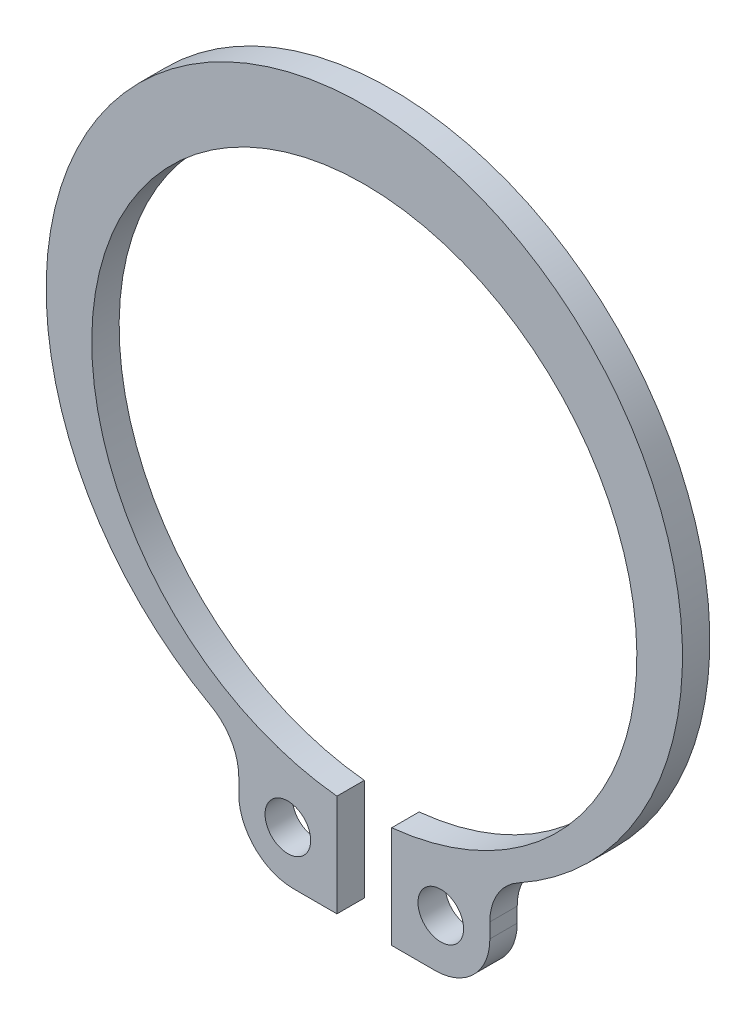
ISO-10303-21;
HEADER;
FILE_DESCRIPTION(('STEP AP214'),'2;1');
FILE_NAME('part.step','',(''),(''),'','','');
FILE_SCHEMA(('AUTOMOTIVE_DESIGN { 1 0 10303 214 1 1 1 1 }'));
ENDSEC;
DATA;
#1=APPLICATION_CONTEXT('core data for automotive mechanical design processes');
#2=APPLICATION_PROTOCOL_DEFINITION('international standard','automotive_design',2000,#1);
#3=PRODUCT_CONTEXT('',#1,'mechanical');
#4=PRODUCT('Part','Part','',(#3));
#5=PRODUCT_RELATED_PRODUCT_CATEGORY('part','',(#4));
#6=PRODUCT_DEFINITION_FORMATION('','',#4);
#7=PRODUCT_DEFINITION_CONTEXT('part definition',#1,'design');
#8=PRODUCT_DEFINITION('design','',#6,#7);
#9=PRODUCT_DEFINITION_SHAPE('','',#8);
#10=(LENGTH_UNIT() NAMED_UNIT(*) SI_UNIT(.MILLI.,.METRE.));
#11=(NAMED_UNIT(*) PLANE_ANGLE_UNIT() SI_UNIT($,.RADIAN.));
#12=(NAMED_UNIT(*) SI_UNIT($,.STERADIAN.) SOLID_ANGLE_UNIT());
#13=UNCERTAINTY_MEASURE_WITH_UNIT(LENGTH_MEASURE(1.E-05),#10,'distance_accuracy_value','');
#14=(GEOMETRIC_REPRESENTATION_CONTEXT(3) GLOBAL_UNCERTAINTY_ASSIGNED_CONTEXT((#13)) GLOBAL_UNIT_ASSIGNED_CONTEXT((#10,
#11,#12)) REPRESENTATION_CONTEXT('',''));
#15=CARTESIAN_POINT('',(0.,0.,0.));
#16=DIRECTION('',(0.,0.,1.));
#17=DIRECTION('',(1.,0.,0.));
#18=AXIS2_PLACEMENT_3D('',#15,#16,#17);
#19=CARTESIAN_POINT('',(-7.90464606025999,-13.3122000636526,1.2));
#20=DIRECTION('',(0.,0.,-1.));
#21=DIRECTION('',(-1.,0.,0.));
#22=AXIS2_PLACEMENT_3D('',#19,#20,#21);
#23=CYLINDRICAL_SURFACE('',#22,2.4);
#24=CARTESIAN_POINT('',(-7.90464606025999,-13.3122000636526,0.));
#25=DIRECTION('',(0.,0.,1.));
#26=DIRECTION('',(1.,0.,0.));
#27=AXIS2_PLACEMENT_3D('',#24,#25,#26);
#28=CIRCLE('',#27,2.4);
#29=CARTESIAN_POINT('',(-5.50464606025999,-13.3122000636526,0.));
#30=VERTEX_POINT('',#29);
#31=CARTESIAN_POINT('',(-6.74433104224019,-11.2113266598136,0.));
#32=VERTEX_POINT('',#31);
#33=EDGE_CURVE('E139',#30,#32,#28,.T.);
#34=ORIENTED_EDGE('',*,*,#33,.F.);
#35=DIRECTION('',(0.,0.,-1.));
#36=VECTOR('',#35,1.);
#37=CARTESIAN_POINT('',(-5.50464606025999,-13.3122000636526,1.2));
#38=LINE('',#37,#36);
#39=CARTESIAN_POINT('',(-5.50464606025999,-13.3122000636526,1.2));
#40=VERTEX_POINT('',#39);
#41=EDGE_CURVE('E44',#40,#30,#38,.T.);
#42=ORIENTED_EDGE('',*,*,#41,.F.);
#43=CARTESIAN_POINT('',(-7.90464606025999,-13.3122000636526,1.2));
#44=DIRECTION('',(0.,0.,1.));
#45=DIRECTION('',(1.,0.,0.));
#46=AXIS2_PLACEMENT_3D('',#43,#44,#45);
#47=CIRCLE('',#46,2.4);
#48=CARTESIAN_POINT('',(-6.74433104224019,-11.2113266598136,1.2));
#49=VERTEX_POINT('',#48);
#50=EDGE_CURVE('E169',#40,#49,#47,.T.);
#51=ORIENTED_EDGE('',*,*,#50,.T.);
#52=DIRECTION('',(0.,0.,-1.));
#53=VECTOR('',#52,1.);
#54=CARTESIAN_POINT('',(-6.74433104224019,-11.2113266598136,1.2));
#55=LINE('',#54,#53);
#56=EDGE_CURVE('E11',#49,#32,#55,.T.);
#57=ORIENTED_EDGE('',*,*,#56,.T.);
#58=EDGE_LOOP('',(#34,#42,#51,#57));
#59=FACE_BOUND('',#58,.T.);
#60=ADVANCED_FACE('F30',(#59),#23,.F.);
#61=CARTESIAN_POINT('',(0.,1.,1.2));
#62=DIRECTION('',(0.,0.,-1.));
#63=DIRECTION('',(-1.,0.,0.));
#64=AXIS2_PLACEMENT_3D('',#61,#62,#63);
#65=CYLINDRICAL_SURFACE('',#64,13.95);
#66=CARTESIAN_POINT('',(0.,1.,0.));
#67=DIRECTION('',(0.,0.,1.));
#68=DIRECTION('',(1.,0.,0.));
#69=AXIS2_PLACEMENT_3D('',#66,#67,#68);
#70=CIRCLE('',#69,13.95);
#71=CARTESIAN_POINT('',(6.74433104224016,-11.2113266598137,0.));
#72=VERTEX_POINT('',#71);
#73=EDGE_CURVE('E121',#72,#32,#70,.T.);
#74=ORIENTED_EDGE('',*,*,#73,.T.);
#75=ORIENTED_EDGE('',*,*,#56,.F.);
#76=CARTESIAN_POINT('',(0.,1.,1.2));
#77=DIRECTION('',(0.,0.,1.));
#78=DIRECTION('',(1.,0.,0.));
#79=AXIS2_PLACEMENT_3D('',#76,#77,#78);
#80=CIRCLE('',#79,13.95);
#81=CARTESIAN_POINT('',(6.74433104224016,-11.2113266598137,1.2));
#82=VERTEX_POINT('',#81);
#83=EDGE_CURVE('E124',#82,#49,#80,.T.);
#84=ORIENTED_EDGE('',*,*,#83,.F.);
#85=DIRECTION('',(0.,0.,-1.));
#86=VECTOR('',#85,1.);
#87=CARTESIAN_POINT('',(6.74433104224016,-11.2113266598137,1.2));
#88=LINE('',#87,#86);
#89=EDGE_CURVE('E33',#82,#72,#88,.T.);
#90=ORIENTED_EDGE('',*,*,#89,.T.);
#91=EDGE_LOOP('',(#74,#75,#84,#90));
#92=FACE_BOUND('',#91,.T.);
#93=ADVANCED_FACE('F119',(#92),#65,.T.);
#94=CARTESIAN_POINT('',(7.90464606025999,-13.3122000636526,1.2));
#95=DIRECTION('',(0.,0.,-1.));
#96=DIRECTION('',(-1.,0.,0.));
#97=AXIS2_PLACEMENT_3D('',#94,#95,#96);
#98=CYLINDRICAL_SURFACE('',#97,2.4);
#99=CARTESIAN_POINT('',(7.90464606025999,-13.3122000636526,0.));
#100=DIRECTION('',(0.,0.,1.));
#101=DIRECTION('',(1.,0.,0.));
#102=AXIS2_PLACEMENT_3D('',#99,#100,#101);
#103=CIRCLE('',#102,2.4);
#104=CARTESIAN_POINT('',(5.50464606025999,-13.3122000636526,0.));
#105=VERTEX_POINT('',#104);
#106=EDGE_CURVE('E130',#72,#105,#103,.T.);
#107=ORIENTED_EDGE('',*,*,#106,.F.);
#108=ORIENTED_EDGE('',*,*,#89,.F.);
#109=CARTESIAN_POINT('',(7.90464606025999,-13.3122000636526,1.2));
#110=DIRECTION('',(0.,0.,1.));
#111=DIRECTION('',(1.,0.,0.));
#112=AXIS2_PLACEMENT_3D('',#109,#110,#111);
#113=CIRCLE('',#112,2.4);
#114=CARTESIAN_POINT('',(5.50464606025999,-13.3122000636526,1.2));
#115=VERTEX_POINT('',#114);
#116=EDGE_CURVE('E172',#82,#115,#113,.T.);
#117=ORIENTED_EDGE('',*,*,#116,.T.);
#118=DIRECTION('',(0.,0.,-1.));
#119=VECTOR('',#118,1.);
#120=CARTESIAN_POINT('',(5.50464606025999,-13.3122000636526,1.2));
#121=LINE('',#120,#119);
#122=EDGE_CURVE('E128',#115,#105,#121,.T.);
#123=ORIENTED_EDGE('',*,*,#122,.T.);
#124=EDGE_LOOP('',(#107,#108,#117,#123));
#125=FACE_BOUND('',#124,.T.);
#126=ADVANCED_FACE('F131',(#125),#98,.F.);
#127=CARTESIAN_POINT('',(5.50464606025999,-13.96,1.2));
#128=DIRECTION('',(-1.,0.,0.));
#129=DIRECTION('',(0.,0.,1.));
#130=AXIS2_PLACEMENT_3D('',#127,#128,#129);
#131=PLANE('',#130);
#132=DIRECTION('',(0.,1.,0.));
#133=VECTOR('',#132,1.);
#134=CARTESIAN_POINT('',(5.50464606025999,-13.96,0.));
#135=LINE('',#134,#133);
#136=CARTESIAN_POINT('',(5.50464606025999,-13.96,0.));
#137=VERTEX_POINT('',#136);
#138=EDGE_CURVE('E135',#137,#105,#135,.T.);
#139=ORIENTED_EDGE('',*,*,#138,.T.);
#140=ORIENTED_EDGE('',*,*,#122,.F.);
#141=DIRECTION('',(0.,1.,0.));
#142=VECTOR('',#141,1.);
#143=CARTESIAN_POINT('',(5.50464606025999,-13.96,1.2));
#144=LINE('',#143,#142);
#145=CARTESIAN_POINT('',(5.50464606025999,-13.96,1.2));
#146=VERTEX_POINT('',#145);
#147=EDGE_CURVE('E174',#146,#115,#144,.T.);
#148=ORIENTED_EDGE('',*,*,#147,.F.);
#149=DIRECTION('',(0.,0.,-1.));
#150=VECTOR('',#149,1.);
#151=CARTESIAN_POINT('',(5.50464606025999,-13.96,1.2));
#152=LINE('',#151,#150);
#153=EDGE_CURVE('E216',#146,#137,#152,.T.);
#154=ORIENTED_EDGE('',*,*,#153,.T.);
#155=EDGE_LOOP('',(#139,#140,#148,#154));
#156=FACE_BOUND('',#155,.T.);
#157=ADVANCED_FACE('F220',(#156),#131,.F.);
#158=CARTESIAN_POINT('',(3.10464606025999,-13.96,1.2));
#159=DIRECTION('',(0.,0.,-1.));
#160=DIRECTION('',(-1.,0.,0.));
#161=AXIS2_PLACEMENT_3D('',#158,#159,#160);
#162=CYLINDRICAL_SURFACE('',#161,2.4);
#163=CARTESIAN_POINT('',(3.10464606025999,-13.96,0.));
#164=DIRECTION('',(0.,0.,1.));
#165=DIRECTION('',(1.,0.,0.));
#166=AXIS2_PLACEMENT_3D('',#163,#164,#165);
#167=CIRCLE('',#166,2.4);
#168=CARTESIAN_POINT('',(3.10464606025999,-16.36,0.));
#169=VERTEX_POINT('',#168);
#170=EDGE_CURVE('E147',#169,#137,#167,.T.);
#171=ORIENTED_EDGE('',*,*,#170,.T.);
#172=ORIENTED_EDGE('',*,*,#153,.F.);
#173=CARTESIAN_POINT('',(3.10464606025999,-13.96,1.2));
#174=DIRECTION('',(0.,0.,1.));
#175=DIRECTION('',(1.,0.,0.));
#176=AXIS2_PLACEMENT_3D('',#173,#174,#175);
#177=CIRCLE('',#176,2.4);
#178=CARTESIAN_POINT('',(3.10464606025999,-16.36,1.2));
#179=VERTEX_POINT('',#178);
#180=EDGE_CURVE('E177',#179,#146,#177,.T.);
#181=ORIENTED_EDGE('',*,*,#180,.F.);
#182=DIRECTION('',(0.,0.,-1.));
#183=VECTOR('',#182,1.);
#184=CARTESIAN_POINT('',(3.10464606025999,-16.36,1.2));
#185=LINE('',#184,#183);
#186=EDGE_CURVE('E214',#179,#169,#185,.T.);
#187=ORIENTED_EDGE('',*,*,#186,.T.);
#188=EDGE_LOOP('',(#171,#172,#181,#187));
#189=FACE_BOUND('',#188,.T.);
#190=ADVANCED_FACE('F224',(#189),#162,.T.);
#191=CARTESIAN_POINT('',(1.2,-16.36,1.2));
#192=DIRECTION('',(0.,1.,0.));
#193=DIRECTION('',(0.,0.,1.));
#194=AXIS2_PLACEMENT_3D('',#191,#192,#193);
#195=PLANE('',#194);
#196=DIRECTION('',(1.,0.,0.));
#197=VECTOR('',#196,1.);
#198=CARTESIAN_POINT('',(1.2,-16.36,0.));
#199=LINE('',#198,#197);
#200=CARTESIAN_POINT('',(1.2,-16.36,0.));
#201=VERTEX_POINT('',#200);
#202=EDGE_CURVE('E150',#201,#169,#199,.T.);
#203=ORIENTED_EDGE('',*,*,#202,.T.);
#204=ORIENTED_EDGE('',*,*,#186,.F.);
#205=DIRECTION('',(1.,0.,0.));
#206=VECTOR('',#205,1.);
#207=CARTESIAN_POINT('',(1.2,-16.36,1.2));
#208=LINE('',#207,#206);
#209=CARTESIAN_POINT('',(1.2,-16.36,1.2));
#210=VERTEX_POINT('',#209);
#211=EDGE_CURVE('E180',#210,#179,#208,.T.);
#212=ORIENTED_EDGE('',*,*,#211,.F.);
#213=DIRECTION('',(0.,0.,-1.));
#214=VECTOR('',#213,1.);
#215=CARTESIAN_POINT('',(1.2,-16.36,1.2));
#216=LINE('',#215,#214);
#217=EDGE_CURVE('E212',#210,#201,#216,.T.);
#218=ORIENTED_EDGE('',*,*,#217,.T.);
#219=EDGE_LOOP('',(#203,#204,#212,#218));
#220=FACE_BOUND('',#219,.T.);
#221=ADVANCED_FACE('F228',(#220),#195,.F.);
#222=CARTESIAN_POINT('',(1.2,-16.36,1.2));
#223=DIRECTION('',(-1.,0.,0.));
#224=DIRECTION('',(0.,-1.,0.));
#225=AXIS2_PLACEMENT_3D('',#222,#223,#224);
#226=PLANE('',#225);
#227=DIRECTION('',(0.,1.,0.));
#228=VECTOR('',#227,1.);
#229=CARTESIAN_POINT('',(1.2,-16.36,0.));
#230=LINE('',#229,#228);
#231=CARTESIAN_POINT('',(1.2,-11.8895962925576,0.));
#232=VERTEX_POINT('',#231);
#233=EDGE_CURVE('E153',#201,#232,#230,.T.);
#234=ORIENTED_EDGE('',*,*,#233,.F.);
#235=ORIENTED_EDGE('',*,*,#217,.F.);
#236=DIRECTION('',(0.,1.,0.));
#237=VECTOR('',#236,1.);
#238=CARTESIAN_POINT('',(1.2,-16.36,1.2));
#239=LINE('',#238,#237);
#240=CARTESIAN_POINT('',(1.2,-11.8895962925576,1.2));
#241=VERTEX_POINT('',#240);
#242=EDGE_CURVE('E183',#210,#241,#239,.T.);
#243=ORIENTED_EDGE('',*,*,#242,.T.);
#244=DIRECTION('',(0.,0.,-1.));
#245=VECTOR('',#244,1.);
#246=CARTESIAN_POINT('',(1.2,-11.8895962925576,1.2));
#247=LINE('',#246,#245);
#248=EDGE_CURVE('E210',#241,#232,#247,.T.);
#249=ORIENTED_EDGE('',*,*,#248,.T.);
#250=EDGE_LOOP('',(#234,#235,#243,#249));
#251=FACE_BOUND('',#250,.T.);
#252=ADVANCED_FACE('F232',(#251),#226,.T.);
#253=CARTESIAN_POINT('',(0.,0.,1.2));
#254=DIRECTION('',(0.,0.,-1.));
#255=DIRECTION('',(-1.,0.,0.));
#256=AXIS2_PLACEMENT_3D('',#253,#254,#255);
#257=CYLINDRICAL_SURFACE('',#256,11.95);
#258=CARTESIAN_POINT('',(0.,0.,0.));
#259=DIRECTION('',(0.,0.,1.));
#260=DIRECTION('',(1.,0.,0.));
#261=AXIS2_PLACEMENT_3D('',#258,#259,#260);
#262=CIRCLE('',#261,11.95);
#263=CARTESIAN_POINT('',(-1.2,-11.8895962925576,0.));
#264=VERTEX_POINT('',#263);
#265=EDGE_CURVE('E156',#232,#264,#262,.T.);
#266=ORIENTED_EDGE('',*,*,#265,.F.);
#267=ORIENTED_EDGE('',*,*,#248,.F.);
#268=CARTESIAN_POINT('',(0.,0.,1.2));
#269=DIRECTION('',(0.,0.,1.));
#270=DIRECTION('',(1.,0.,0.));
#271=AXIS2_PLACEMENT_3D('',#268,#269,#270);
#272=CIRCLE('',#271,11.95);
#273=CARTESIAN_POINT('',(-1.2,-11.8895962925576,1.2));
#274=VERTEX_POINT('',#273);
#275=EDGE_CURVE('E186',#241,#274,#272,.T.);
#276=ORIENTED_EDGE('',*,*,#275,.T.);
#277=DIRECTION('',(0.,0.,-1.));
#278=VECTOR('',#277,1.);
#279=CARTESIAN_POINT('',(-1.2,-11.8895962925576,1.2));
#280=LINE('',#279,#278);
#281=EDGE_CURVE('E208',#274,#264,#280,.T.);
#282=ORIENTED_EDGE('',*,*,#281,.T.);
#283=EDGE_LOOP('',(#266,#267,#276,#282));
#284=FACE_BOUND('',#283,.T.);
#285=ADVANCED_FACE('F236',(#284),#257,.F.);
#286=CARTESIAN_POINT('',(-1.2,-16.36,1.2));
#287=DIRECTION('',(-1.,0.,0.));
#288=DIRECTION('',(0.,-1.,0.));
#289=AXIS2_PLACEMENT_3D('',#286,#287,#288);
#290=PLANE('',#289);
#291=DIRECTION('',(0.,1.,0.));
#292=VECTOR('',#291,1.);
#293=CARTESIAN_POINT('',(-1.2,-16.36,0.));
#294=LINE('',#293,#292);
#295=CARTESIAN_POINT('',(-1.2,-16.36,0.));
#296=VERTEX_POINT('',#295);
#297=EDGE_CURVE('E159',#296,#264,#294,.T.);
#298=ORIENTED_EDGE('',*,*,#297,.T.);
#299=ORIENTED_EDGE('',*,*,#281,.F.);
#300=DIRECTION('',(0.,1.,0.));
#301=VECTOR('',#300,1.);
#302=CARTESIAN_POINT('',(-1.2,-16.36,1.2));
#303=LINE('',#302,#301);
#304=CARTESIAN_POINT('',(-1.2,-16.36,1.2));
#305=VERTEX_POINT('',#304);
#306=EDGE_CURVE('E189',#305,#274,#303,.T.);
#307=ORIENTED_EDGE('',*,*,#306,.F.);
#308=DIRECTION('',(0.,0.,-1.));
#309=VECTOR('',#308,1.);
#310=CARTESIAN_POINT('',(-1.2,-16.36,1.2));
#311=LINE('',#310,#309);
#312=EDGE_CURVE('E206',#305,#296,#311,.T.);
#313=ORIENTED_EDGE('',*,*,#312,.T.);
#314=EDGE_LOOP('',(#298,#299,#307,#313));
#315=FACE_BOUND('',#314,.T.);
#316=ADVANCED_FACE('F241',(#315),#290,.F.);
#317=CARTESIAN_POINT('',(-3.10464606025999,-16.36,1.2));
#318=DIRECTION('',(0.,1.,0.));
#319=DIRECTION('',(0.,0.,1.));
#320=AXIS2_PLACEMENT_3D('',#317,#318,#319);
#321=PLANE('',#320);
#322=DIRECTION('',(1.,0.,0.));
#323=VECTOR('',#322,1.);
#324=CARTESIAN_POINT('',(-3.10464606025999,-16.36,0.));
#325=LINE('',#324,#323);
#326=CARTESIAN_POINT('',(-3.10464606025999,-16.36,0.));
#327=VERTEX_POINT('',#326);
#328=EDGE_CURVE('E162',#327,#296,#325,.T.);
#329=ORIENTED_EDGE('',*,*,#328,.T.);
#330=ORIENTED_EDGE('',*,*,#312,.F.);
#331=DIRECTION('',(1.,0.,0.));
#332=VECTOR('',#331,1.);
#333=CARTESIAN_POINT('',(-3.10464606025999,-16.36,1.2));
#334=LINE('',#333,#332);
#335=CARTESIAN_POINT('',(-3.10464606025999,-16.36,1.2));
#336=VERTEX_POINT('',#335);
#337=EDGE_CURVE('E192',#336,#305,#334,.T.);
#338=ORIENTED_EDGE('',*,*,#337,.F.);
#339=DIRECTION('',(0.,0.,-1.));
#340=VECTOR('',#339,1.);
#341=CARTESIAN_POINT('',(-3.10464606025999,-16.36,1.2));
#342=LINE('',#341,#340);
#343=EDGE_CURVE('E204',#336,#327,#342,.T.);
#344=ORIENTED_EDGE('',*,*,#343,.T.);
#345=EDGE_LOOP('',(#329,#330,#338,#344));
#346=FACE_BOUND('',#345,.T.);
#347=ADVANCED_FACE('F245',(#346),#321,.F.);
#348=CARTESIAN_POINT('',(-3.10464606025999,-13.96,1.2));
#349=DIRECTION('',(0.,0.,-1.));
#350=DIRECTION('',(-1.,0.,0.));
#351=AXIS2_PLACEMENT_3D('',#348,#349,#350);
#352=CYLINDRICAL_SURFACE('',#351,2.4);
#353=CARTESIAN_POINT('',(-3.10464606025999,-13.96,0.));
#354=DIRECTION('',(0.,0.,1.));
#355=DIRECTION('',(1.,0.,0.));
#356=AXIS2_PLACEMENT_3D('',#353,#354,#355);
#357=CIRCLE('',#356,2.4);
#358=CARTESIAN_POINT('',(-5.50464606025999,-13.96,0.));
#359=VERTEX_POINT('',#358);
#360=EDGE_CURVE('E165',#359,#327,#357,.T.);
#361=ORIENTED_EDGE('',*,*,#360,.T.);
#362=ORIENTED_EDGE('',*,*,#343,.F.);
#363=CARTESIAN_POINT('',(-3.10464606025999,-13.96,1.2));
#364=DIRECTION('',(0.,0.,1.));
#365=DIRECTION('',(1.,0.,0.));
#366=AXIS2_PLACEMENT_3D('',#363,#364,#365);
#367=CIRCLE('',#366,2.4);
#368=CARTESIAN_POINT('',(-5.50464606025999,-13.96,1.2));
#369=VERTEX_POINT('',#368);
#370=EDGE_CURVE('E195',#369,#336,#367,.T.);
#371=ORIENTED_EDGE('',*,*,#370,.F.);
#372=DIRECTION('',(0.,0.,-1.));
#373=VECTOR('',#372,1.);
#374=CARTESIAN_POINT('',(-5.50464606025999,-13.96,1.2));
#375=LINE('',#374,#373);
#376=EDGE_CURVE('E51',#369,#359,#375,.T.);
#377=ORIENTED_EDGE('',*,*,#376,.T.);
#378=EDGE_LOOP('',(#361,#362,#371,#377));
#379=FACE_BOUND('',#378,.T.);
#380=ADVANCED_FACE('F247',(#379),#352,.T.);
#381=CARTESIAN_POINT('',(-5.50464606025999,-13.3122000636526,1.2));
#382=DIRECTION('',(1.,0.,0.));
#383=DIRECTION('',(0.,0.,-1.));
#384=AXIS2_PLACEMENT_3D('',#381,#382,#383);
#385=PLANE('',#384);
#386=DIRECTION('',(0.,-1.,0.));
#387=VECTOR('',#386,1.);
#388=CARTESIAN_POINT('',(-5.50464606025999,-13.3122000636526,0.));
#389=LINE('',#388,#387);
#390=EDGE_CURVE('E168',#30,#359,#389,.T.);
#391=ORIENTED_EDGE('',*,*,#390,.T.);
#392=ORIENTED_EDGE('',*,*,#376,.F.);
#393=DIRECTION('',(0.,-1.,0.));
#394=VECTOR('',#393,1.);
#395=CARTESIAN_POINT('',(-5.50464606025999,-13.3122000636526,1.2));
#396=LINE('',#395,#394);
#397=EDGE_CURVE('E198',#40,#369,#396,.T.);
#398=ORIENTED_EDGE('',*,*,#397,.F.);
#399=ORIENTED_EDGE('',*,*,#41,.T.);
#400=EDGE_LOOP('',(#391,#392,#398,#399));
#401=FACE_BOUND('',#400,.T.);
#402=ADVANCED_FACE('F251',(#401),#385,.F.);
#403=CARTESIAN_POINT('',(-7.90464606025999,-13.3122000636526,1.2));
#404=DIRECTION('',(0.,0.,1.));
#405=DIRECTION('',(1.,0.,0.));
#406=AXIS2_PLACEMENT_3D('',#403,#404,#405);
#407=PLANE('',#406);
#408=CARTESIAN_POINT('',(-3.35232303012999,-14.15,1.2));
#409=DIRECTION('',(0.,0.,-1.));
#410=DIRECTION('',(0.,1.,0.));
#411=AXIS2_PLACEMENT_3D('',#408,#409,#410);
#412=CIRCLE('',#411,1.);
#413=CARTESIAN_POINT('',(-3.35232303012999,-13.15,1.2));
#414=VERTEX_POINT('',#413);
#415=EDGE_CURVE('E325',#414,#414,#412,.T.);
#416=ORIENTED_EDGE('',*,*,#415,.T.);
#417=EDGE_LOOP('',(#416));
#418=FACE_BOUND('',#417,.T.);
#419=CARTESIAN_POINT('',(3.35232303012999,-14.15,1.2));
#420=DIRECTION('',(0.,0.,-1.));
#421=DIRECTION('',(0.,1.,0.));
#422=AXIS2_PLACEMENT_3D('',#419,#420,#421);
#423=CIRCLE('',#422,1.);
#424=CARTESIAN_POINT('',(3.35232303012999,-13.15,1.2));
#425=VERTEX_POINT('',#424);
#426=EDGE_CURVE('E141',#425,#425,#423,.T.);
#427=ORIENTED_EDGE('',*,*,#426,.T.);
#428=EDGE_LOOP('',(#427));
#429=FACE_BOUND('',#428,.T.);
#430=ORIENTED_EDGE('',*,*,#50,.F.);
#431=ORIENTED_EDGE('',*,*,#397,.T.);
#432=ORIENTED_EDGE('',*,*,#370,.T.);
#433=ORIENTED_EDGE('',*,*,#337,.T.);
#434=ORIENTED_EDGE('',*,*,#306,.T.);
#435=ORIENTED_EDGE('',*,*,#275,.F.);
#436=ORIENTED_EDGE('',*,*,#242,.F.);
#437=ORIENTED_EDGE('',*,*,#211,.T.);
#438=ORIENTED_EDGE('',*,*,#180,.T.);
#439=ORIENTED_EDGE('',*,*,#147,.T.);
#440=ORIENTED_EDGE('',*,*,#116,.F.);
#441=ORIENTED_EDGE('',*,*,#83,.T.);
#442=EDGE_LOOP('',(#430,#431,#432,#433,#434,#435,#436,#437,#438,#439,#440,#441));
#443=FACE_BOUND('',#442,.T.);
#444=ADVANCED_FACE('F250',(#418,#429,#443),#407,.T.);
#445=CARTESIAN_POINT('',(-7.90464606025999,-13.3122000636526,0.));
#446=DIRECTION('',(0.,0.,1.));
#447=DIRECTION('',(1.,0.,0.));
#448=AXIS2_PLACEMENT_3D('',#445,#446,#447);
#449=PLANE('',#448);
#450=CARTESIAN_POINT('',(-3.35232303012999,-14.15,0.));
#451=DIRECTION('',(0.,0.,1.));
#452=DIRECTION('',(0.,1.,0.));
#453=AXIS2_PLACEMENT_3D('',#450,#451,#452);
#454=CIRCLE('',#453,1.);
#455=CARTESIAN_POINT('',(-3.35232303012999,-13.15,0.));
#456=VERTEX_POINT('',#455);
#457=EDGE_CURVE('E328',#456,#456,#454,.T.);
#458=ORIENTED_EDGE('',*,*,#457,.T.);
#459=EDGE_LOOP('',(#458));
#460=FACE_BOUND('',#459,.T.);
#461=CARTESIAN_POINT('',(3.35232303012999,-14.15,0.));
#462=DIRECTION('',(0.,0.,1.));
#463=DIRECTION('',(0.,1.,0.));
#464=AXIS2_PLACEMENT_3D('',#461,#462,#463);
#465=CIRCLE('',#464,1.);
#466=CARTESIAN_POINT('',(3.35232303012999,-13.15,0.));
#467=VERTEX_POINT('',#466);
#468=EDGE_CURVE('E330',#467,#467,#465,.T.);
#469=ORIENTED_EDGE('',*,*,#468,.T.);
#470=EDGE_LOOP('',(#469));
#471=FACE_BOUND('',#470,.T.);
#472=ORIENTED_EDGE('',*,*,#33,.T.);
#473=ORIENTED_EDGE('',*,*,#73,.F.);
#474=ORIENTED_EDGE('',*,*,#106,.T.);
#475=ORIENTED_EDGE('',*,*,#138,.F.);
#476=ORIENTED_EDGE('',*,*,#170,.F.);
#477=ORIENTED_EDGE('',*,*,#202,.F.);
#478=ORIENTED_EDGE('',*,*,#233,.T.);
#479=ORIENTED_EDGE('',*,*,#265,.T.);
#480=ORIENTED_EDGE('',*,*,#297,.F.);
#481=ORIENTED_EDGE('',*,*,#328,.F.);
#482=ORIENTED_EDGE('',*,*,#360,.F.);
#483=ORIENTED_EDGE('',*,*,#390,.F.);
#484=EDGE_LOOP('',(#472,#473,#474,#475,#476,#477,#478,#479,#480,#481,#482,#483));
#485=FACE_BOUND('',#484,.T.);
#486=ADVANCED_FACE('F137',(#460,#471,#485),#449,.F.);
#487=CARTESIAN_POINT('',(3.35232303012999,-14.15,0.));
#488=DIRECTION('',(0.,0.,1.));
#489=DIRECTION('',(0.,1.,0.));
#490=AXIS2_PLACEMENT_3D('',#487,#488,#489);
#491=CYLINDRICAL_SURFACE('',#490,1.);
#492=ORIENTED_EDGE('',*,*,#426,.F.);
#493=EDGE_LOOP('',(#492));
#494=FACE_BOUND('',#493,.T.);
#495=ORIENTED_EDGE('',*,*,#468,.F.);
#496=EDGE_LOOP('',(#495));
#497=FACE_BOUND('',#496,.T.);
#498=ADVANCED_FACE('F304',(#494,#497),#491,.F.);
#499=CARTESIAN_POINT('',(-3.35232303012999,-14.15,0.));
#500=DIRECTION('',(0.,0.,1.));
#501=DIRECTION('',(0.,1.,0.));
#502=AXIS2_PLACEMENT_3D('',#499,#500,#501);
#503=CYLINDRICAL_SURFACE('',#502,1.);
#504=ORIENTED_EDGE('',*,*,#415,.F.);
#505=EDGE_LOOP('',(#504));
#506=FACE_BOUND('',#505,.T.);
#507=ORIENTED_EDGE('',*,*,#457,.F.);
#508=EDGE_LOOP('',(#507));
#509=FACE_BOUND('',#508,.T.);
#510=ADVANCED_FACE('F312',(#506,#509),#503,.F.);
#511=CLOSED_SHELL('',(#60,#93,#126,#157,#190,#221,#252,#285,#316,#347,#380,#402,#444,#486,#498,#510));
#512=MANIFOLD_SOLID_BREP('B2',#511);
#513=ADVANCED_BREP_SHAPE_REPRESENTATION('',(#18,#512),#14);
#514=SHAPE_DEFINITION_REPRESENTATION(#9,#513);
ENDSEC;
END-ISO-10303-21;
